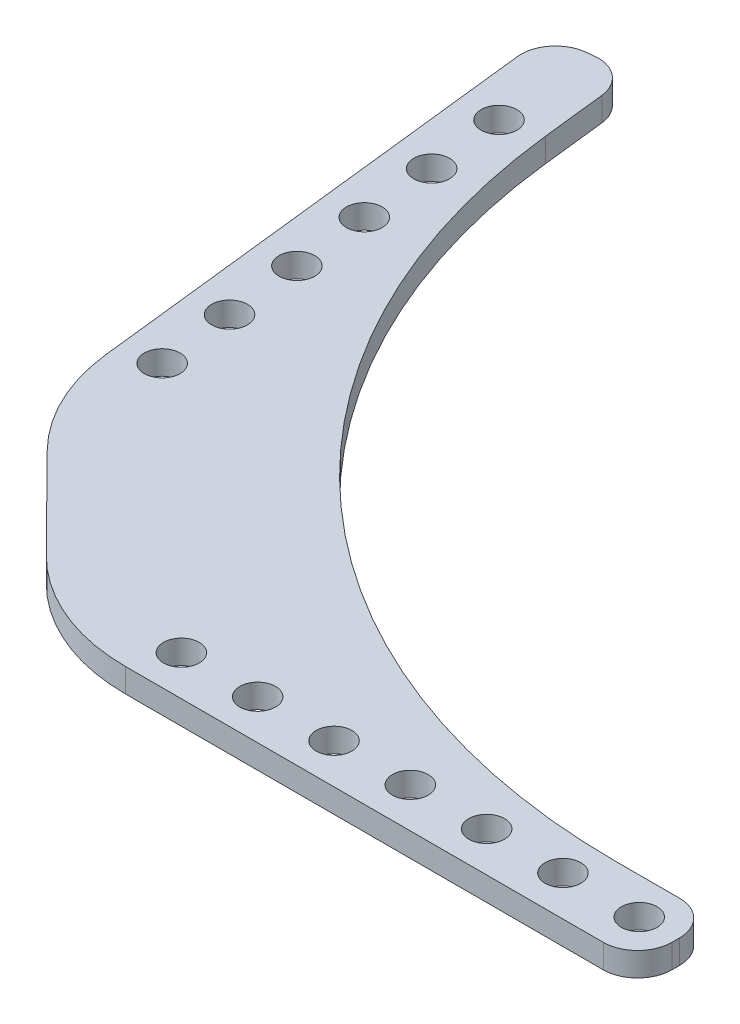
ISO-10303-21;
HEADER;
FILE_DESCRIPTION(('STEP AP214'),'2;1');
FILE_NAME('part.step','',(''),(''),'','','');
FILE_SCHEMA(('AUTOMOTIVE_DESIGN { 1 0 10303 214 1 1 1 1 }'));
ENDSEC;
DATA;
#1=APPLICATION_CONTEXT('core data for automotive mechanical design processes');
#2=APPLICATION_PROTOCOL_DEFINITION('international standard','automotive_design',2000,#1);
#3=PRODUCT_CONTEXT('',#1,'mechanical');
#4=PRODUCT('Part','Part','',(#3));
#5=PRODUCT_RELATED_PRODUCT_CATEGORY('part','',(#4));
#6=PRODUCT_DEFINITION_FORMATION('','',#4);
#7=PRODUCT_DEFINITION_CONTEXT('part definition',#1,'design');
#8=PRODUCT_DEFINITION('design','',#6,#7);
#9=PRODUCT_DEFINITION_SHAPE('','',#8);
#10=(LENGTH_UNIT() NAMED_UNIT(*) SI_UNIT(.MILLI.,.METRE.));
#11=(NAMED_UNIT(*) PLANE_ANGLE_UNIT() SI_UNIT($,.RADIAN.));
#12=(NAMED_UNIT(*) SI_UNIT($,.STERADIAN.) SOLID_ANGLE_UNIT());
#13=UNCERTAINTY_MEASURE_WITH_UNIT(LENGTH_MEASURE(1.E-05),#10,'distance_accuracy_value','');
#14=(GEOMETRIC_REPRESENTATION_CONTEXT(3) GLOBAL_UNCERTAINTY_ASSIGNED_CONTEXT((#13)) GLOBAL_UNIT_ASSIGNED_CONTEXT((#10,
#11,#12)) REPRESENTATION_CONTEXT('',''));
#15=CARTESIAN_POINT('',(0.,0.,0.));
#16=DIRECTION('',(0.,0.,1.));
#17=DIRECTION('',(1.,0.,0.));
#18=AXIS2_PLACEMENT_3D('',#15,#16,#17);
#19=CARTESIAN_POINT('',(-13.0169135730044,3.175,-88.9));
#20=DIRECTION('',(0.,1.,0.));
#21=DIRECTION('',(0.,0.,1.));
#22=AXIS2_PLACEMENT_3D('',#19,#20,#21);
#23=PLANE('',#22);
#24=CARTESIAN_POINT('',(-55.8883614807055,3.175,4.84965063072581));
#25=DIRECTION('',(0.,1.,0.));
#26=DIRECTION('',(0.,0.,1.));
#27=AXIS2_PLACEMENT_3D('',#24,#25,#26);
#28=CIRCLE('',#27,2.38125);
#29=CARTESIAN_POINT('',(-55.8883614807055,3.175,7.23090063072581));
#30=VERTEX_POINT('',#29);
#31=EDGE_CURVE('E329',#30,#30,#28,.T.);
#32=ORIENTED_EDGE('',*,*,#31,.F.);
#33=EDGE_LOOP('',(#32));
#34=FACE_BOUND('',#33,.T.);
#35=CARTESIAN_POINT('',(-35.5683614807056,3.175,4.84965063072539));
#36=DIRECTION('',(0.,1.,0.));
#37=DIRECTION('',(0.,0.,1.));
#38=AXIS2_PLACEMENT_3D('',#35,#36,#37);
#39=CIRCLE('',#38,2.38125);
#40=CARTESIAN_POINT('',(-35.5683614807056,3.175,7.23090063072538));
#41=VERTEX_POINT('',#40);
#42=EDGE_CURVE('E317',#41,#41,#39,.T.);
#43=ORIENTED_EDGE('',*,*,#42,.F.);
#44=EDGE_LOOP('',(#43));
#45=FACE_BOUND('',#44,.T.);
#46=CARTESIAN_POINT('',(-15.2483614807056,3.175,4.84965063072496));
#47=DIRECTION('',(0.,1.,0.));
#48=DIRECTION('',(0.,0.,1.));
#49=AXIS2_PLACEMENT_3D('',#46,#47,#48);
#50=CIRCLE('',#49,2.38125);
#51=CARTESIAN_POINT('',(-15.2483614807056,3.175,7.23090063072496));
#52=VERTEX_POINT('',#51);
#53=EDGE_CURVE('E305',#52,#52,#50,.T.);
#54=ORIENTED_EDGE('',*,*,#53,.F.);
#55=EDGE_LOOP('',(#54));
#56=FACE_BOUND('',#55,.T.);
#57=CARTESIAN_POINT('',(-101.816305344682,3.175,-37.3332472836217));
#58=DIRECTION('',(0.,1.,0.));
#59=DIRECTION('',(0.,0.,1.));
#60=AXIS2_PLACEMENT_3D('',#57,#58,#59);
#61=CIRCLE('',#60,2.38125);
#62=CARTESIAN_POINT('',(-101.816305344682,3.175,-34.9519972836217));
#63=VERTEX_POINT('',#62);
#64=EDGE_CURVE('E293',#63,#63,#61,.T.);
#65=ORIENTED_EDGE('',*,*,#64,.F.);
#66=EDGE_LOOP('',(#65));
#67=FACE_BOUND('',#66,.T.);
#68=CARTESIAN_POINT('',(-104.074122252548,3.175,-57.5274212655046));
#69=DIRECTION('',(0.,1.,0.));
#70=DIRECTION('',(0.,0.,1.));
#71=AXIS2_PLACEMENT_3D('',#68,#69,#70);
#72=CIRCLE('',#71,2.38125);
#73=CARTESIAN_POINT('',(-104.074122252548,3.175,-55.1461712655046));
#74=VERTEX_POINT('',#73);
#75=EDGE_CURVE('E281',#74,#74,#72,.T.);
#76=ORIENTED_EDGE('',*,*,#75,.F.);
#77=EDGE_LOOP('',(#76));
#78=FACE_BOUND('',#77,.T.);
#79=CARTESIAN_POINT('',(-5.08836148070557,3.175,4.84965063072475));
#80=DIRECTION('',(0.,1.,0.));
#81=DIRECTION('',(0.,0.,1.));
#82=AXIS2_PLACEMENT_3D('',#79,#80,#81);
#83=CIRCLE('',#82,2.38125);
#84=CARTESIAN_POINT('',(-5.08836148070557,3.175,7.23090063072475));
#85=VERTEX_POINT('',#84);
#86=EDGE_CURVE('E269',#85,#85,#83,.T.);
#87=ORIENTED_EDGE('',*,*,#86,.F.);
#88=EDGE_LOOP('',(#87));
#89=FACE_BOUND('',#88,.T.);
#90=DIRECTION('',(0.112162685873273,0.,0.993689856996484));
#91=VECTOR('',#90,1.);
#92=CARTESIAN_POINT('',(-112.408442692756,3.175,-86.2641860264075));
#93=LINE('',#92,#91);
#94=CARTESIAN_POINT('',(-112.408442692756,3.175,-86.2641860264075));
#95=VERTEX_POINT('',#94);
#96=CARTESIAN_POINT('',(-105.437628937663,3.175,-24.5072222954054));
#97=VERTEX_POINT('',#96);
#98=EDGE_CURVE('E181',#95,#97,#93,.T.);
#99=ORIENTED_EDGE('',*,*,#98,.T.);
#100=CARTESIAN_POINT('',(-80.1979065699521,3.175,-27.3561545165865));
#101=DIRECTION('',(0.,1.,0.));
#102=DIRECTION('',(0.,0.,1.));
#103=AXIS2_PLACEMENT_3D('',#100,#101,#102);
#104=CIRCLE('',#103,25.4);
#105=CARTESIAN_POINT('',(-98.246675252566,3.175,-9.48433454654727));
#106=VERTEX_POINT('',#105);
#107=EDGE_CURVE('E43',#97,#106,#104,.T.);
#108=ORIENTED_EDGE('',*,*,#107,.T.);
#109=DIRECTION('',(0.703614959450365,0.,0.710581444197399));
#110=VECTOR('',#109,1.);
#111=CARTESIAN_POINT('',(-104.448932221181,3.175,-15.748));
#112=LINE('',#111,#110);
#113=CARTESIAN_POINT('',(-86.2493065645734,3.175,2.63181997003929));
#114=VERTEX_POINT('',#113);
#115=EDGE_CURVE('E180',#106,#114,#112,.T.);
#116=ORIENTED_EDGE('',*,*,#115,.T.);
#117=CARTESIAN_POINT('',(-68.2005378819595,3.175,-15.24));
#118=DIRECTION('',(0.,1.,0.));
#119=DIRECTION('',(0.,0.,1.));
#120=AXIS2_PLACEMENT_3D('',#117,#118,#119);
#121=CIRCLE('',#120,25.4);
#122=CARTESIAN_POINT('',(-68.2005378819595,3.175,10.16));
#123=VERTEX_POINT('',#122);
#124=EDGE_CURVE('E50',#114,#123,#121,.T.);
#125=ORIENTED_EDGE('',*,*,#124,.T.);
#126=DIRECTION('',(1.,0.,0.));
#127=VECTOR('',#126,1.);
#128=CARTESIAN_POINT('',(-4.57200000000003,3.175,10.16));
#129=LINE('',#128,#127);
#130=CARTESIAN_POINT('',(-4.57200000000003,3.175,10.16));
#131=VERTEX_POINT('',#130);
#132=EDGE_CURVE('E189',#123,#131,#129,.T.);
#133=ORIENTED_EDGE('',*,*,#132,.T.);
#134=CARTESIAN_POINT('',(-4.572,3.175,5.588));
#135=DIRECTION('',(0.,1.,0.));
#136=DIRECTION('',(0.,0.,-1.));
#137=AXIS2_PLACEMENT_3D('',#134,#135,#136);
#138=CIRCLE('',#137,4.572);
#139=CARTESIAN_POINT('',(0.,3.175,5.58799999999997));
#140=VERTEX_POINT('',#139);
#141=EDGE_CURVE('E258',#131,#140,#138,.T.);
#142=ORIENTED_EDGE('',*,*,#141,.T.);
#143=DIRECTION('',(0.,0.,-1.));
#144=VECTOR('',#143,1.);
#145=CARTESIAN_POINT('',(0.,3.175,4.57200000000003));
#146=LINE('',#145,#144);
#147=CARTESIAN_POINT('',(0.,3.175,4.57200000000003));
#148=VERTEX_POINT('',#147);
#149=EDGE_CURVE('E256',#140,#148,#146,.T.);
#150=ORIENTED_EDGE('',*,*,#149,.T.);
#151=CARTESIAN_POINT('',(-4.572,3.175,4.572));
#152=DIRECTION('',(0.,1.,0.));
#153=DIRECTION('',(0.,0.,1.));
#154=AXIS2_PLACEMENT_3D('',#151,#152,#153);
#155=CIRCLE('',#154,4.572);
#156=CARTESIAN_POINT('',(-4.57200000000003,3.175,0.));
#157=VERTEX_POINT('',#156);
#158=EDGE_CURVE('E254',#148,#157,#155,.T.);
#159=ORIENTED_EDGE('',*,*,#158,.T.);
#160=DIRECTION('',(-1.,0.,0.));
#161=VECTOR('',#160,1.);
#162=CARTESIAN_POINT('',(-13.0169135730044,3.175,0.));
#163=LINE('',#162,#161);
#164=CARTESIAN_POINT('',(-13.0169135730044,3.175,0.));
#165=VERTEX_POINT('',#164);
#166=EDGE_CURVE('E154',#157,#165,#163,.T.);
#167=ORIENTED_EDGE('',*,*,#166,.T.);
#168=CARTESIAN_POINT('',(-13.0169135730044,3.175,-88.9));
#169=DIRECTION('',(0.,-1.,0.));
#170=DIRECTION('',(0.,0.,1.));
#171=AXIS2_PLACEMENT_3D('',#168,#169,#170);
#172=CIRCLE('',#171,88.9);
#173=CARTESIAN_POINT('',(-101.355941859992,3.175,-78.928737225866));
#174=VERTEX_POINT('',#173);
#175=EDGE_CURVE('E149',#165,#174,#172,.T.);
#176=ORIENTED_EDGE('',*,*,#175,.T.);
#177=DIRECTION('',(-0.112162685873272,0.,-0.993689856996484));
#178=VECTOR('',#177,1.);
#179=CARTESIAN_POINT('',(-102.311355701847,3.175,-87.3930944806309));
#180=LINE('',#179,#178);
#181=CARTESIAN_POINT('',(-102.311355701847,3.175,-87.3930944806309));
#182=VERTEX_POINT('',#181);
#183=EDGE_CURVE('E139',#174,#182,#180,.T.);
#184=ORIENTED_EDGE('',*,*,#183,.T.);
#185=CARTESIAN_POINT('',(-106.854505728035,3.175,-86.8802866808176));
#186=DIRECTION('',(0.,1.,0.));
#187=DIRECTION('',(0.,0.,-1.));
#188=AXIS2_PLACEMENT_3D('',#185,#186,#187);
#189=CIRCLE('',#188,4.57200000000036);
#190=CARTESIAN_POINT('',(-107.362514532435,3.175,-91.423975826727));
#191=VERTEX_POINT('',#190);
#192=EDGE_CURVE('E148',#182,#191,#189,.T.);
#193=ORIENTED_EDGE('',*,*,#192,.T.);
#194=DIRECTION('',(-0.993807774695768,0.,0.111113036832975));
#195=VECTOR('',#194,1.);
#196=CARTESIAN_POINT('',(-108.372228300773,3.175,-91.3110844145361));
#197=LINE('',#196,#195);
#198=CARTESIAN_POINT('',(-108.372228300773,3.175,-91.3110844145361));
#199=VERTEX_POINT('',#198);
#200=EDGE_CURVE('E243',#191,#199,#197,.T.);
#201=ORIENTED_EDGE('',*,*,#200,.T.);
#202=CARTESIAN_POINT('',(-107.864219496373,3.175,-86.7673952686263));
#203=DIRECTION('',(0.,1.,0.));
#204=DIRECTION('',(0.,0.,-1.));
#205=AXIS2_PLACEMENT_3D('',#202,#203,#204);
#206=CIRCLE('',#205,4.5720000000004);
#207=EDGE_CURVE('E262',#199,#95,#206,.T.);
#208=ORIENTED_EDGE('',*,*,#207,.T.);
#209=EDGE_LOOP('',(#99,#108,#116,#125,#133,#142,#150,#159,#167,#176,#184,#193,#201,#208));
#210=FACE_BOUND('',#209,.T.);
#211=CARTESIAN_POINT('',(-106.331939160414,3.175,-77.7215952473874));
#212=DIRECTION('',(0.,1.,0.));
#213=DIRECTION('',(0.,0.,1.));
#214=AXIS2_PLACEMENT_3D('',#211,#212,#213);
#215=CIRCLE('',#214,2.38125);
#216=CARTESIAN_POINT('',(-106.331939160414,3.175,-75.3403452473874));
#217=VERTEX_POINT('',#216);
#218=EDGE_CURVE('E252',#217,#217,#215,.T.);
#219=ORIENTED_EDGE('',*,*,#218,.F.);
#220=EDGE_LOOP('',(#219));
#221=FACE_BOUND('',#220,.T.);
#222=CARTESIAN_POINT('',(-105.203030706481,3.175,-67.624508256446));
#223=DIRECTION('',(0.,1.,0.));
#224=DIRECTION('',(0.,0.,1.));
#225=AXIS2_PLACEMENT_3D('',#222,#223,#224);
#226=CIRCLE('',#225,2.38125);
#227=CARTESIAN_POINT('',(-105.203030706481,3.175,-65.243258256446));
#228=VERTEX_POINT('',#227);
#229=EDGE_CURVE('E275',#228,#228,#226,.T.);
#230=ORIENTED_EDGE('',*,*,#229,.F.);
#231=EDGE_LOOP('',(#230));
#232=FACE_BOUND('',#231,.T.);
#233=CARTESIAN_POINT('',(-102.945213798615,3.175,-47.4303342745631));
#234=DIRECTION('',(0.,1.,0.));
#235=DIRECTION('',(0.,0.,1.));
#236=AXIS2_PLACEMENT_3D('',#233,#234,#235);
#237=CIRCLE('',#236,2.38125);
#238=CARTESIAN_POINT('',(-102.945213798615,3.175,-45.0490842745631));
#239=VERTEX_POINT('',#238);
#240=EDGE_CURVE('E287',#239,#239,#237,.T.);
#241=ORIENTED_EDGE('',*,*,#240,.F.);
#242=EDGE_LOOP('',(#241));
#243=FACE_BOUND('',#242,.T.);
#244=CARTESIAN_POINT('',(-100.687396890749,3.175,-27.2361602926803));
#245=DIRECTION('',(0.,1.,0.));
#246=DIRECTION('',(0.,0.,1.));
#247=AXIS2_PLACEMENT_3D('',#244,#245,#246);
#248=CIRCLE('',#247,2.38125000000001);
#249=CARTESIAN_POINT('',(-100.687396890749,3.175,-24.8549102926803));
#250=VERTEX_POINT('',#249);
#251=EDGE_CURVE('E299',#250,#250,#248,.T.);
#252=ORIENTED_EDGE('',*,*,#251,.F.);
#253=EDGE_LOOP('',(#252));
#254=FACE_BOUND('',#253,.T.);
#255=CARTESIAN_POINT('',(-25.4083614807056,3.175,4.84965063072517));
#256=DIRECTION('',(0.,1.,0.));
#257=DIRECTION('',(0.,0.,1.));
#258=AXIS2_PLACEMENT_3D('',#255,#256,#257);
#259=CIRCLE('',#258,2.38125);
#260=CARTESIAN_POINT('',(-25.4083614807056,3.175,7.23090063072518));
#261=VERTEX_POINT('',#260);
#262=EDGE_CURVE('E311',#261,#261,#259,.T.);
#263=ORIENTED_EDGE('',*,*,#262,.F.);
#264=EDGE_LOOP('',(#263));
#265=FACE_BOUND('',#264,.T.);
#266=CARTESIAN_POINT('',(-45.7283614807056,3.175,4.8496506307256));
#267=DIRECTION('',(0.,1.,0.));
#268=DIRECTION('',(0.,0.,1.));
#269=AXIS2_PLACEMENT_3D('',#266,#267,#268);
#270=CIRCLE('',#269,2.38125);
#271=CARTESIAN_POINT('',(-45.7283614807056,3.175,7.2309006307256));
#272=VERTEX_POINT('',#271);
#273=EDGE_CURVE('E323',#272,#272,#270,.T.);
#274=ORIENTED_EDGE('',*,*,#273,.F.);
#275=EDGE_LOOP('',(#274));
#276=FACE_BOUND('',#275,.T.);
#277=CARTESIAN_POINT('',(-66.0483614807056,3.175,4.84965063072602));
#278=DIRECTION('',(0.,1.,0.));
#279=DIRECTION('',(0.,0.,1.));
#280=AXIS2_PLACEMENT_3D('',#277,#278,#279);
#281=CIRCLE('',#280,2.38125000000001);
#282=CARTESIAN_POINT('',(-66.0483614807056,3.175,7.23090063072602));
#283=VERTEX_POINT('',#282);
#284=EDGE_CURVE('E335',#283,#283,#281,.T.);
#285=ORIENTED_EDGE('',*,*,#284,.F.);
#286=EDGE_LOOP('',(#285));
#287=FACE_BOUND('',#286,.T.);
#288=ADVANCED_FACE('F35',(#34,#45,#56,#67,#78,#89,#210,#221,#232,#243,#254,#265,#276,#287),#23,.T.);
#289=CARTESIAN_POINT('',(-13.0169135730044,0.,-88.9));
#290=DIRECTION('',(0.,1.,0.));
#291=DIRECTION('',(0.,0.,1.));
#292=AXIS2_PLACEMENT_3D('',#289,#290,#291);
#293=PLANE('',#292);
#294=DIRECTION('',(0.703614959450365,0.,0.710581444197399));
#295=VECTOR('',#294,1.);
#296=CARTESIAN_POINT('',(-104.448932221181,0.,-15.748));
#297=LINE('',#296,#295);
#298=CARTESIAN_POINT('',(-98.246675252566,0.,-9.48433454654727));
#299=VERTEX_POINT('',#298);
#300=CARTESIAN_POINT('',(-86.2493065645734,0.,2.63181997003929));
#301=VERTEX_POINT('',#300);
#302=EDGE_CURVE('E198',#299,#301,#297,.T.);
#303=ORIENTED_EDGE('',*,*,#302,.F.);
#304=CARTESIAN_POINT('',(-80.1979065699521,0.,-27.3561545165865));
#305=DIRECTION('',(0.,1.,0.));
#306=DIRECTION('',(0.,0.,1.));
#307=AXIS2_PLACEMENT_3D('',#304,#305,#306);
#308=CIRCLE('',#307,25.4);
#309=CARTESIAN_POINT('',(-105.437628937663,0.,-24.5072222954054));
#310=VERTEX_POINT('',#309);
#311=EDGE_CURVE('E175',#299,#310,#308,.F.);
#312=ORIENTED_EDGE('',*,*,#311,.T.);
#313=DIRECTION('',(0.112162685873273,0.,0.993689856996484));
#314=VECTOR('',#313,1.);
#315=CARTESIAN_POINT('',(-112.408442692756,0.,-86.2641860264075));
#316=LINE('',#315,#314);
#317=CARTESIAN_POINT('',(-112.408442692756,0.,-86.2641860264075));
#318=VERTEX_POINT('',#317);
#319=EDGE_CURVE('E197',#318,#310,#316,.T.);
#320=ORIENTED_EDGE('',*,*,#319,.F.);
#321=CARTESIAN_POINT('',(-107.864219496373,0.,-86.7673952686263));
#322=DIRECTION('',(0.,1.,0.));
#323=DIRECTION('',(0.,0.,-1.));
#324=AXIS2_PLACEMENT_3D('',#321,#322,#323);
#325=CIRCLE('',#324,4.5720000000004);
#326=CARTESIAN_POINT('',(-108.372228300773,0.,-91.3110844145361));
#327=VERTEX_POINT('',#326);
#328=EDGE_CURVE('E203',#327,#318,#325,.T.);
#329=ORIENTED_EDGE('',*,*,#328,.F.);
#330=DIRECTION('',(-0.993807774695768,0.,0.111113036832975));
#331=VECTOR('',#330,1.);
#332=CARTESIAN_POINT('',(-108.372228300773,0.,-91.3110844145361));
#333=LINE('',#332,#331);
#334=CARTESIAN_POINT('',(-107.362514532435,0.,-91.423975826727));
#335=VERTEX_POINT('',#334);
#336=EDGE_CURVE('E207',#335,#327,#333,.T.);
#337=ORIENTED_EDGE('',*,*,#336,.F.);
#338=CARTESIAN_POINT('',(-106.854505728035,0.,-86.8802866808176));
#339=DIRECTION('',(0.,1.,0.));
#340=DIRECTION('',(0.,0.,-1.));
#341=AXIS2_PLACEMENT_3D('',#338,#339,#340);
#342=CIRCLE('',#341,4.57200000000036);
#343=CARTESIAN_POINT('',(-102.311355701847,0.,-87.3930944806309));
#344=VERTEX_POINT('',#343);
#345=EDGE_CURVE('E246',#344,#335,#342,.T.);
#346=ORIENTED_EDGE('',*,*,#345,.F.);
#347=DIRECTION('',(-0.112162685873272,0.,-0.993689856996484));
#348=VECTOR('',#347,1.);
#349=CARTESIAN_POINT('',(-102.311355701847,0.,-87.3930944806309));
#350=LINE('',#349,#348);
#351=CARTESIAN_POINT('',(-101.355941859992,0.,-78.928737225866));
#352=VERTEX_POINT('',#351);
#353=EDGE_CURVE('E247',#352,#344,#350,.T.);
#354=ORIENTED_EDGE('',*,*,#353,.F.);
#355=CARTESIAN_POINT('',(-13.0169135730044,0.,-88.9));
#356=DIRECTION('',(0.,-1.,0.));
#357=DIRECTION('',(0.,0.,1.));
#358=AXIS2_PLACEMENT_3D('',#355,#356,#357);
#359=CIRCLE('',#358,88.9);
#360=CARTESIAN_POINT('',(-13.0169135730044,0.,0.));
#361=VERTEX_POINT('',#360);
#362=EDGE_CURVE('E162',#361,#352,#359,.T.);
#363=ORIENTED_EDGE('',*,*,#362,.F.);
#364=DIRECTION('',(-1.,0.,0.));
#365=VECTOR('',#364,1.);
#366=CARTESIAN_POINT('',(-13.0169135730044,0.,0.));
#367=LINE('',#366,#365);
#368=CARTESIAN_POINT('',(-4.57200000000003,0.,0.));
#369=VERTEX_POINT('',#368);
#370=EDGE_CURVE('E158',#369,#361,#367,.T.);
#371=ORIENTED_EDGE('',*,*,#370,.F.);
#372=CARTESIAN_POINT('',(-4.572,0.,4.572));
#373=DIRECTION('',(0.,1.,0.));
#374=DIRECTION('',(0.,0.,1.));
#375=AXIS2_PLACEMENT_3D('',#372,#373,#374);
#376=CIRCLE('',#375,4.572);
#377=CARTESIAN_POINT('',(0.,0.,4.57200000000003));
#378=VERTEX_POINT('',#377);
#379=EDGE_CURVE('E216',#378,#369,#376,.T.);
#380=ORIENTED_EDGE('',*,*,#379,.F.);
#381=DIRECTION('',(0.,0.,-1.));
#382=VECTOR('',#381,1.);
#383=CARTESIAN_POINT('',(0.,0.,4.57200000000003));
#384=LINE('',#383,#382);
#385=CARTESIAN_POINT('',(0.,0.,5.58799999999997));
#386=VERTEX_POINT('',#385);
#387=EDGE_CURVE('E214',#386,#378,#384,.T.);
#388=ORIENTED_EDGE('',*,*,#387,.F.);
#389=CARTESIAN_POINT('',(-4.572,0.,5.588));
#390=DIRECTION('',(0.,1.,0.));
#391=DIRECTION('',(0.,0.,-1.));
#392=AXIS2_PLACEMENT_3D('',#389,#390,#391);
#393=CIRCLE('',#392,4.572);
#394=CARTESIAN_POINT('',(-4.57200000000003,0.,10.16));
#395=VERTEX_POINT('',#394);
#396=EDGE_CURVE('E212',#395,#386,#393,.T.);
#397=ORIENTED_EDGE('',*,*,#396,.F.);
#398=DIRECTION('',(1.,0.,0.));
#399=VECTOR('',#398,1.);
#400=CARTESIAN_POINT('',(-4.57200000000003,0.,10.16));
#401=LINE('',#400,#399);
#402=CARTESIAN_POINT('',(-68.2005378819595,0.,10.16));
#403=VERTEX_POINT('',#402);
#404=EDGE_CURVE('E205',#403,#395,#401,.T.);
#405=ORIENTED_EDGE('',*,*,#404,.F.);
#406=CARTESIAN_POINT('',(-68.2005378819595,0.,-15.24));
#407=DIRECTION('',(0.,1.,0.));
#408=DIRECTION('',(0.,0.,1.));
#409=AXIS2_PLACEMENT_3D('',#406,#407,#408);
#410=CIRCLE('',#409,25.4);
#411=EDGE_CURVE('E173',#403,#301,#410,.F.);
#412=ORIENTED_EDGE('',*,*,#411,.T.);
#413=EDGE_LOOP('',(#303,#312,#320,#329,#337,#346,#354,#363,#371,#380,#388,#397,#405,#412));
#414=FACE_BOUND('',#413,.T.);
#415=CARTESIAN_POINT('',(-106.331939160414,0.,-77.7215952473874));
#416=DIRECTION('',(0.,1.,0.));
#417=DIRECTION('',(0.,0.,1.));
#418=AXIS2_PLACEMENT_3D('',#415,#416,#417);
#419=CIRCLE('',#418,2.38125);
#420=CARTESIAN_POINT('',(-106.331939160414,0.,-75.3403452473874));
#421=VERTEX_POINT('',#420);
#422=EDGE_CURVE('E266',#421,#421,#419,.T.);
#423=ORIENTED_EDGE('',*,*,#422,.T.);
#424=EDGE_LOOP('',(#423));
#425=FACE_BOUND('',#424,.T.);
#426=CARTESIAN_POINT('',(-5.08836148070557,0.,4.84965063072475));
#427=DIRECTION('',(0.,1.,0.));
#428=DIRECTION('',(0.,0.,1.));
#429=AXIS2_PLACEMENT_3D('',#426,#427,#428);
#430=CIRCLE('',#429,2.38125);
#431=CARTESIAN_POINT('',(-5.08836148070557,0.,7.23090063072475));
#432=VERTEX_POINT('',#431);
#433=EDGE_CURVE('E272',#432,#432,#430,.T.);
#434=ORIENTED_EDGE('',*,*,#433,.T.);
#435=EDGE_LOOP('',(#434));
#436=FACE_BOUND('',#435,.T.);
#437=CARTESIAN_POINT('',(-105.203030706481,0.,-67.624508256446));
#438=DIRECTION('',(0.,1.,0.));
#439=DIRECTION('',(0.,0.,1.));
#440=AXIS2_PLACEMENT_3D('',#437,#438,#439);
#441=CIRCLE('',#440,2.38125);
#442=CARTESIAN_POINT('',(-105.203030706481,0.,-65.243258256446));
#443=VERTEX_POINT('',#442);
#444=EDGE_CURVE('E278',#443,#443,#441,.T.);
#445=ORIENTED_EDGE('',*,*,#444,.T.);
#446=EDGE_LOOP('',(#445));
#447=FACE_BOUND('',#446,.T.);
#448=CARTESIAN_POINT('',(-104.074122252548,0.,-57.5274212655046));
#449=DIRECTION('',(0.,1.,0.));
#450=DIRECTION('',(0.,0.,1.));
#451=AXIS2_PLACEMENT_3D('',#448,#449,#450);
#452=CIRCLE('',#451,2.38125);
#453=CARTESIAN_POINT('',(-104.074122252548,0.,-55.1461712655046));
#454=VERTEX_POINT('',#453);
#455=EDGE_CURVE('E284',#454,#454,#452,.T.);
#456=ORIENTED_EDGE('',*,*,#455,.T.);
#457=EDGE_LOOP('',(#456));
#458=FACE_BOUND('',#457,.T.);
#459=CARTESIAN_POINT('',(-102.945213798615,0.,-47.4303342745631));
#460=DIRECTION('',(0.,1.,0.));
#461=DIRECTION('',(0.,0.,1.));
#462=AXIS2_PLACEMENT_3D('',#459,#460,#461);
#463=CIRCLE('',#462,2.38125);
#464=CARTESIAN_POINT('',(-102.945213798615,0.,-45.0490842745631));
#465=VERTEX_POINT('',#464);
#466=EDGE_CURVE('E290',#465,#465,#463,.T.);
#467=ORIENTED_EDGE('',*,*,#466,.T.);
#468=EDGE_LOOP('',(#467));
#469=FACE_BOUND('',#468,.T.);
#470=CARTESIAN_POINT('',(-101.816305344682,0.,-37.3332472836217));
#471=DIRECTION('',(0.,1.,0.));
#472=DIRECTION('',(0.,0.,1.));
#473=AXIS2_PLACEMENT_3D('',#470,#471,#472);
#474=CIRCLE('',#473,2.38125);
#475=CARTESIAN_POINT('',(-101.816305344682,0.,-34.9519972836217));
#476=VERTEX_POINT('',#475);
#477=EDGE_CURVE('E296',#476,#476,#474,.T.);
#478=ORIENTED_EDGE('',*,*,#477,.T.);
#479=EDGE_LOOP('',(#478));
#480=FACE_BOUND('',#479,.T.);
#481=CARTESIAN_POINT('',(-100.687396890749,0.,-27.2361602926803));
#482=DIRECTION('',(0.,1.,0.));
#483=DIRECTION('',(0.,0.,1.));
#484=AXIS2_PLACEMENT_3D('',#481,#482,#483);
#485=CIRCLE('',#484,2.38125000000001);
#486=CARTESIAN_POINT('',(-100.687396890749,0.,-24.8549102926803));
#487=VERTEX_POINT('',#486);
#488=EDGE_CURVE('E302',#487,#487,#485,.T.);
#489=ORIENTED_EDGE('',*,*,#488,.T.);
#490=EDGE_LOOP('',(#489));
#491=FACE_BOUND('',#490,.T.);
#492=CARTESIAN_POINT('',(-15.2483614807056,0.,4.84965063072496));
#493=DIRECTION('',(0.,1.,0.));
#494=DIRECTION('',(0.,0.,1.));
#495=AXIS2_PLACEMENT_3D('',#492,#493,#494);
#496=CIRCLE('',#495,2.38125);
#497=CARTESIAN_POINT('',(-15.2483614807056,0.,7.23090063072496));
#498=VERTEX_POINT('',#497);
#499=EDGE_CURVE('E308',#498,#498,#496,.T.);
#500=ORIENTED_EDGE('',*,*,#499,.T.);
#501=EDGE_LOOP('',(#500));
#502=FACE_BOUND('',#501,.T.);
#503=CARTESIAN_POINT('',(-25.4083614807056,0.,4.84965063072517));
#504=DIRECTION('',(0.,1.,0.));
#505=DIRECTION('',(0.,0.,1.));
#506=AXIS2_PLACEMENT_3D('',#503,#504,#505);
#507=CIRCLE('',#506,2.38125);
#508=CARTESIAN_POINT('',(-25.4083614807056,0.,7.23090063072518));
#509=VERTEX_POINT('',#508);
#510=EDGE_CURVE('E314',#509,#509,#507,.T.);
#511=ORIENTED_EDGE('',*,*,#510,.T.);
#512=EDGE_LOOP('',(#511));
#513=FACE_BOUND('',#512,.T.);
#514=CARTESIAN_POINT('',(-35.5683614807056,0.,4.84965063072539));
#515=DIRECTION('',(0.,1.,0.));
#516=DIRECTION('',(0.,0.,1.));
#517=AXIS2_PLACEMENT_3D('',#514,#515,#516);
#518=CIRCLE('',#517,2.38125);
#519=CARTESIAN_POINT('',(-35.5683614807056,0.,7.23090063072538));
#520=VERTEX_POINT('',#519);
#521=EDGE_CURVE('E320',#520,#520,#518,.T.);
#522=ORIENTED_EDGE('',*,*,#521,.T.);
#523=EDGE_LOOP('',(#522));
#524=FACE_BOUND('',#523,.T.);
#525=CARTESIAN_POINT('',(-45.7283614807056,0.,4.8496506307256));
#526=DIRECTION('',(0.,1.,0.));
#527=DIRECTION('',(0.,0.,1.));
#528=AXIS2_PLACEMENT_3D('',#525,#526,#527);
#529=CIRCLE('',#528,2.38125);
#530=CARTESIAN_POINT('',(-45.7283614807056,0.,7.2309006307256));
#531=VERTEX_POINT('',#530);
#532=EDGE_CURVE('E326',#531,#531,#529,.T.);
#533=ORIENTED_EDGE('',*,*,#532,.T.);
#534=EDGE_LOOP('',(#533));
#535=FACE_BOUND('',#534,.T.);
#536=CARTESIAN_POINT('',(-55.8883614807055,0.,4.84965063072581));
#537=DIRECTION('',(0.,1.,0.));
#538=DIRECTION('',(0.,0.,1.));
#539=AXIS2_PLACEMENT_3D('',#536,#537,#538);
#540=CIRCLE('',#539,2.38125);
#541=CARTESIAN_POINT('',(-55.8883614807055,0.,7.23090063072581));
#542=VERTEX_POINT('',#541);
#543=EDGE_CURVE('E332',#542,#542,#540,.T.);
#544=ORIENTED_EDGE('',*,*,#543,.T.);
#545=EDGE_LOOP('',(#544));
#546=FACE_BOUND('',#545,.T.);
#547=CARTESIAN_POINT('',(-66.0483614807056,0.,4.84965063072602));
#548=DIRECTION('',(0.,1.,0.));
#549=DIRECTION('',(0.,0.,1.));
#550=AXIS2_PLACEMENT_3D('',#547,#548,#549);
#551=CIRCLE('',#550,2.38125000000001);
#552=CARTESIAN_POINT('',(-66.0483614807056,0.,7.23090063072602));
#553=VERTEX_POINT('',#552);
#554=EDGE_CURVE('E338',#553,#553,#551,.T.);
#555=ORIENTED_EDGE('',*,*,#554,.T.);
#556=EDGE_LOOP('',(#555));
#557=FACE_BOUND('',#556,.T.);
#558=ADVANCED_FACE('F194',(#414,#425,#436,#447,#458,#469,#480,#491,#502,#513,#524,#535,#546,
#557),#293,.F.);
#559=CARTESIAN_POINT('',(-13.0169135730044,3.175,-88.9));
#560=DIRECTION('',(0.,-1.,0.));
#561=DIRECTION('',(0.,0.,-1.));
#562=AXIS2_PLACEMENT_3D('',#559,#560,#561);
#563=CYLINDRICAL_SURFACE('',#562,88.9);
#564=ORIENTED_EDGE('',*,*,#362,.T.);
#565=DIRECTION('',(0.,-1.,0.));
#566=VECTOR('',#565,1.);
#567=CARTESIAN_POINT('',(-101.355941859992,3.175,-78.928737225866));
#568=LINE('',#567,#566);
#569=EDGE_CURVE('E143',#174,#352,#568,.T.);
#570=ORIENTED_EDGE('',*,*,#569,.F.);
#571=ORIENTED_EDGE('',*,*,#175,.F.);
#572=DIRECTION('',(0.,-1.,0.));
#573=VECTOR('',#572,1.);
#574=CARTESIAN_POINT('',(-13.0169135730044,3.175,0.));
#575=LINE('',#574,#573);
#576=EDGE_CURVE('E219',#165,#361,#575,.T.);
#577=ORIENTED_EDGE('',*,*,#576,.T.);
#578=EDGE_LOOP('',(#564,#570,#571,#577));
#579=FACE_BOUND('',#578,.T.);
#580=ADVANCED_FACE('F160',(#579),#563,.F.);
#581=CARTESIAN_POINT('',(-102.311355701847,3.175,-87.3930944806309));
#582=DIRECTION('',(-0.993689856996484,0.,0.112162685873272));
#583=DIRECTION('',(0.112162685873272,0.,0.993689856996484));
#584=AXIS2_PLACEMENT_3D('',#581,#582,#583);
#585=PLANE('',#584);
#586=ORIENTED_EDGE('',*,*,#353,.T.);
#587=DIRECTION('',(0.,-1.,0.));
#588=VECTOR('',#587,1.);
#589=CARTESIAN_POINT('',(-102.311355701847,3.175,-87.3930944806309));
#590=LINE('',#589,#588);
#591=EDGE_CURVE('E146',#182,#344,#590,.T.);
#592=ORIENTED_EDGE('',*,*,#591,.F.);
#593=ORIENTED_EDGE('',*,*,#183,.F.);
#594=ORIENTED_EDGE('',*,*,#569,.T.);
#595=EDGE_LOOP('',(#586,#592,#593,#594));
#596=FACE_BOUND('',#595,.T.);
#597=ADVANCED_FACE('F141',(#596),#585,.F.);
#598=CARTESIAN_POINT('',(-106.854505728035,3.175,-86.8802866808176));
#599=DIRECTION('',(0.,-1.,0.));
#600=DIRECTION('',(0.,0.,-1.));
#601=AXIS2_PLACEMENT_3D('',#598,#599,#600);
#602=CYLINDRICAL_SURFACE('',#601,4.57200000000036);
#603=ORIENTED_EDGE('',*,*,#345,.T.);
#604=DIRECTION('',(0.,-1.,0.));
#605=VECTOR('',#604,1.);
#606=CARTESIAN_POINT('',(-107.362514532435,3.175,-91.423975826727));
#607=LINE('',#606,#605);
#608=EDGE_CURVE('E167',#191,#335,#607,.T.);
#609=ORIENTED_EDGE('',*,*,#608,.F.);
#610=ORIENTED_EDGE('',*,*,#192,.F.);
#611=ORIENTED_EDGE('',*,*,#591,.T.);
#612=EDGE_LOOP('',(#603,#609,#610,#611));
#613=FACE_BOUND('',#612,.T.);
#614=ADVANCED_FACE('F390',(#613),#602,.T.);
#615=CARTESIAN_POINT('',(-108.372228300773,3.175,-91.3110844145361));
#616=DIRECTION('',(0.111113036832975,0.,0.993807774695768));
#617=DIRECTION('',(0.993807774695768,0.,-0.111113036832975));
#618=AXIS2_PLACEMENT_3D('',#615,#616,#617);
#619=PLANE('',#618);
#620=ORIENTED_EDGE('',*,*,#336,.T.);
#621=DIRECTION('',(0.,-1.,0.));
#622=VECTOR('',#621,1.);
#623=CARTESIAN_POINT('',(-108.372228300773,3.175,-91.3110844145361));
#624=LINE('',#623,#622);
#625=EDGE_CURVE('E234',#199,#327,#624,.T.);
#626=ORIENTED_EDGE('',*,*,#625,.F.);
#627=ORIENTED_EDGE('',*,*,#200,.F.);
#628=ORIENTED_EDGE('',*,*,#608,.T.);
#629=EDGE_LOOP('',(#620,#626,#627,#628));
#630=FACE_BOUND('',#629,.T.);
#631=ADVANCED_FACE('F241',(#630),#619,.F.);
#632=CARTESIAN_POINT('',(-107.864219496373,3.175,-86.7673952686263));
#633=DIRECTION('',(0.,-1.,0.));
#634=DIRECTION('',(0.,0.,-1.));
#635=AXIS2_PLACEMENT_3D('',#632,#633,#634);
#636=CYLINDRICAL_SURFACE('',#635,4.5720000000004);
#637=ORIENTED_EDGE('',*,*,#328,.T.);
#638=DIRECTION('',(0.,-1.,0.));
#639=VECTOR('',#638,1.);
#640=CARTESIAN_POINT('',(-112.408442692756,3.175,-86.2641860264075));
#641=LINE('',#640,#639);
#642=EDGE_CURVE('E202',#95,#318,#641,.T.);
#643=ORIENTED_EDGE('',*,*,#642,.F.);
#644=ORIENTED_EDGE('',*,*,#207,.F.);
#645=ORIENTED_EDGE('',*,*,#625,.T.);
#646=EDGE_LOOP('',(#637,#643,#644,#645));
#647=FACE_BOUND('',#646,.T.);
#648=ADVANCED_FACE('F384',(#647),#636,.T.);
#649=CARTESIAN_POINT('',(-112.408442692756,3.175,-86.2641860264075));
#650=DIRECTION('',(0.993689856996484,0.,-0.112162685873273));
#651=DIRECTION('',(-0.112162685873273,0.,-0.993689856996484));
#652=AXIS2_PLACEMENT_3D('',#649,#650,#651);
#653=PLANE('',#652);
#654=ORIENTED_EDGE('',*,*,#319,.T.);
#655=DIRECTION('',(0.,-1.,0.));
#656=VECTOR('',#655,1.);
#657=CARTESIAN_POINT('',(-105.437628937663,3.175,-24.5072222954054));
#658=LINE('',#657,#656);
#659=EDGE_CURVE('E58',#310,#97,#658,.F.);
#660=ORIENTED_EDGE('',*,*,#659,.T.);
#661=ORIENTED_EDGE('',*,*,#98,.F.);
#662=ORIENTED_EDGE('',*,*,#642,.T.);
#663=EDGE_LOOP('',(#654,#660,#661,#662));
#664=FACE_BOUND('',#663,.T.);
#665=ADVANCED_FACE('F200',(#664),#653,.F.);
#666=CARTESIAN_POINT('',(-104.448932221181,3.175,-15.748));
#667=DIRECTION('',(0.710581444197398,0.,-0.703614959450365));
#668=DIRECTION('',(-0.703614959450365,0.,-0.710581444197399));
#669=AXIS2_PLACEMENT_3D('',#666,#667,#668);
#670=PLANE('',#669);
#671=ORIENTED_EDGE('',*,*,#115,.F.);
#672=DIRECTION('',(0.,-1.,0.));
#673=VECTOR('',#672,1.);
#674=CARTESIAN_POINT('',(-98.246675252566,3.175,-9.48433454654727));
#675=LINE('',#674,#673);
#676=EDGE_CURVE('E165',#106,#299,#675,.T.);
#677=ORIENTED_EDGE('',*,*,#676,.T.);
#678=ORIENTED_EDGE('',*,*,#302,.T.);
#679=DIRECTION('',(0.,-1.,0.));
#680=VECTOR('',#679,1.);
#681=CARTESIAN_POINT('',(-86.2493065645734,3.175,2.63181997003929));
#682=LINE('',#681,#680);
#683=EDGE_CURVE('E163',#301,#114,#682,.F.);
#684=ORIENTED_EDGE('',*,*,#683,.T.);
#685=EDGE_LOOP('',(#671,#677,#678,#684));
#686=FACE_BOUND('',#685,.T.);
#687=ADVANCED_FACE('F185',(#686),#670,.F.);
#688=CARTESIAN_POINT('',(-4.57200000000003,3.175,10.16));
#689=DIRECTION('',(0.,0.,-1.));
#690=DIRECTION('',(-1.,0.,0.));
#691=AXIS2_PLACEMENT_3D('',#688,#689,#690);
#692=PLANE('',#691);
#693=ORIENTED_EDGE('',*,*,#132,.F.);
#694=DIRECTION('',(0.,-1.,0.));
#695=VECTOR('',#694,1.);
#696=CARTESIAN_POINT('',(-68.2005378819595,3.175,10.16));
#697=LINE('',#696,#695);
#698=EDGE_CURVE('E11',#123,#403,#697,.T.);
#699=ORIENTED_EDGE('',*,*,#698,.T.);
#700=ORIENTED_EDGE('',*,*,#404,.T.);
#701=DIRECTION('',(0.,-1.,0.));
#702=VECTOR('',#701,1.);
#703=CARTESIAN_POINT('',(-4.57200000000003,3.175,10.16));
#704=LINE('',#703,#702);
#705=EDGE_CURVE('E230',#131,#395,#704,.T.);
#706=ORIENTED_EDGE('',*,*,#705,.F.);
#707=EDGE_LOOP('',(#693,#699,#700,#706));
#708=FACE_BOUND('',#707,.T.);
#709=ADVANCED_FACE('F375',(#708),#692,.F.);
#710=CARTESIAN_POINT('',(-4.572,3.175,5.588));
#711=DIRECTION('',(0.,-1.,0.));
#712=DIRECTION('',(0.,0.,-1.));
#713=AXIS2_PLACEMENT_3D('',#710,#711,#712);
#714=CYLINDRICAL_SURFACE('',#713,4.572);
#715=ORIENTED_EDGE('',*,*,#396,.T.);
#716=DIRECTION('',(0.,-1.,0.));
#717=VECTOR('',#716,1.);
#718=CARTESIAN_POINT('',(0.,3.175,5.58799999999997));
#719=LINE('',#718,#717);
#720=EDGE_CURVE('E227',#140,#386,#719,.T.);
#721=ORIENTED_EDGE('',*,*,#720,.F.);
#722=ORIENTED_EDGE('',*,*,#141,.F.);
#723=ORIENTED_EDGE('',*,*,#705,.T.);
#724=EDGE_LOOP('',(#715,#721,#722,#723));
#725=FACE_BOUND('',#724,.T.);
#726=ADVANCED_FACE('F371',(#725),#714,.T.);
#727=CARTESIAN_POINT('',(0.,3.175,4.57200000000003));
#728=DIRECTION('',(-1.,0.,0.));
#729=DIRECTION('',(0.,0.,1.));
#730=AXIS2_PLACEMENT_3D('',#727,#728,#729);
#731=PLANE('',#730);
#732=ORIENTED_EDGE('',*,*,#387,.T.);
#733=DIRECTION('',(0.,-1.,0.));
#734=VECTOR('',#733,1.);
#735=CARTESIAN_POINT('',(0.,3.175,4.57200000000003));
#736=LINE('',#735,#734);
#737=EDGE_CURVE('E224',#148,#378,#736,.T.);
#738=ORIENTED_EDGE('',*,*,#737,.F.);
#739=ORIENTED_EDGE('',*,*,#149,.F.);
#740=ORIENTED_EDGE('',*,*,#720,.T.);
#741=EDGE_LOOP('',(#732,#738,#739,#740));
#742=FACE_BOUND('',#741,.T.);
#743=ADVANCED_FACE('F367',(#742),#731,.F.);
#744=CARTESIAN_POINT('',(-4.572,3.175,4.572));
#745=DIRECTION('',(0.,-1.,0.));
#746=DIRECTION('',(0.,0.,-1.));
#747=AXIS2_PLACEMENT_3D('',#744,#745,#746);
#748=CYLINDRICAL_SURFACE('',#747,4.572);
#749=ORIENTED_EDGE('',*,*,#379,.T.);
#750=DIRECTION('',(0.,-1.,0.));
#751=VECTOR('',#750,1.);
#752=CARTESIAN_POINT('',(-4.57200000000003,3.175,0.));
#753=LINE('',#752,#751);
#754=EDGE_CURVE('E221',#157,#369,#753,.T.);
#755=ORIENTED_EDGE('',*,*,#754,.F.);
#756=ORIENTED_EDGE('',*,*,#158,.F.);
#757=ORIENTED_EDGE('',*,*,#737,.T.);
#758=EDGE_LOOP('',(#749,#755,#756,#757));
#759=FACE_BOUND('',#758,.T.);
#760=ADVANCED_FACE('F363',(#759),#748,.T.);
#761=CARTESIAN_POINT('',(-13.0169135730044,3.175,0.));
#762=DIRECTION('',(0.,0.,1.));
#763=DIRECTION('',(1.,0.,0.));
#764=AXIS2_PLACEMENT_3D('',#761,#762,#763);
#765=PLANE('',#764);
#766=ORIENTED_EDGE('',*,*,#370,.T.);
#767=ORIENTED_EDGE('',*,*,#576,.F.);
#768=ORIENTED_EDGE('',*,*,#166,.F.);
#769=ORIENTED_EDGE('',*,*,#754,.T.);
#770=EDGE_LOOP('',(#766,#767,#768,#769));
#771=FACE_BOUND('',#770,.T.);
#772=ADVANCED_FACE('F360',(#771),#765,.F.);
#773=CARTESIAN_POINT('',(-106.331939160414,3.175,-77.7215952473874));
#774=DIRECTION('',(0.,-1.,0.));
#775=DIRECTION('',(0.,0.,-1.));
#776=AXIS2_PLACEMENT_3D('',#773,#774,#775);
#777=CYLINDRICAL_SURFACE('',#776,2.38125);
#778=ORIENTED_EDGE('',*,*,#218,.T.);
#779=EDGE_LOOP('',(#778));
#780=FACE_BOUND('',#779,.T.);
#781=ORIENTED_EDGE('',*,*,#422,.F.);
#782=EDGE_LOOP('',(#781));
#783=FACE_BOUND('',#782,.T.);
#784=ADVANCED_FACE('F357',(#780,#783),#777,.F.);
#785=CARTESIAN_POINT('',(-5.08836148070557,3.175,4.84965063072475));
#786=DIRECTION('',(0.,-1.,0.));
#787=DIRECTION('',(0.,0.,-1.));
#788=AXIS2_PLACEMENT_3D('',#785,#786,#787);
#789=CYLINDRICAL_SURFACE('',#788,2.38125);
#790=ORIENTED_EDGE('',*,*,#86,.T.);
#791=EDGE_LOOP('',(#790));
#792=FACE_BOUND('',#791,.T.);
#793=ORIENTED_EDGE('',*,*,#433,.F.);
#794=EDGE_LOOP('',(#793));
#795=FACE_BOUND('',#794,.T.);
#796=ADVANCED_FACE('F444',(#792,#795),#789,.F.);
#797=CARTESIAN_POINT('',(-105.203030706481,3.175,-67.624508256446));
#798=DIRECTION('',(0.,-1.,0.));
#799=DIRECTION('',(0.,0.,-1.));
#800=AXIS2_PLACEMENT_3D('',#797,#798,#799);
#801=CYLINDRICAL_SURFACE('',#800,2.38125);
#802=ORIENTED_EDGE('',*,*,#229,.T.);
#803=EDGE_LOOP('',(#802));
#804=FACE_BOUND('',#803,.T.);
#805=ORIENTED_EDGE('',*,*,#444,.F.);
#806=EDGE_LOOP('',(#805));
#807=FACE_BOUND('',#806,.T.);
#808=ADVANCED_FACE('F441',(#804,#807),#801,.F.);
#809=CARTESIAN_POINT('',(-104.074122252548,3.175,-57.5274212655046));
#810=DIRECTION('',(0.,-1.,0.));
#811=DIRECTION('',(0.,0.,-1.));
#812=AXIS2_PLACEMENT_3D('',#809,#810,#811);
#813=CYLINDRICAL_SURFACE('',#812,2.38125);
#814=ORIENTED_EDGE('',*,*,#75,.T.);
#815=EDGE_LOOP('',(#814));
#816=FACE_BOUND('',#815,.T.);
#817=ORIENTED_EDGE('',*,*,#455,.F.);
#818=EDGE_LOOP('',(#817));
#819=FACE_BOUND('',#818,.T.);
#820=ADVANCED_FACE('F437',(#816,#819),#813,.F.);
#821=CARTESIAN_POINT('',(-102.945213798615,3.175,-47.4303342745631));
#822=DIRECTION('',(0.,-1.,0.));
#823=DIRECTION('',(0.,0.,-1.));
#824=AXIS2_PLACEMENT_3D('',#821,#822,#823);
#825=CYLINDRICAL_SURFACE('',#824,2.38125);
#826=ORIENTED_EDGE('',*,*,#240,.T.);
#827=EDGE_LOOP('',(#826));
#828=FACE_BOUND('',#827,.T.);
#829=ORIENTED_EDGE('',*,*,#466,.F.);
#830=EDGE_LOOP('',(#829));
#831=FACE_BOUND('',#830,.T.);
#832=ADVANCED_FACE('F433',(#828,#831),#825,.F.);
#833=CARTESIAN_POINT('',(-101.816305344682,3.175,-37.3332472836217));
#834=DIRECTION('',(0.,-1.,0.));
#835=DIRECTION('',(0.,0.,-1.));
#836=AXIS2_PLACEMENT_3D('',#833,#834,#835);
#837=CYLINDRICAL_SURFACE('',#836,2.38125);
#838=ORIENTED_EDGE('',*,*,#64,.T.);
#839=EDGE_LOOP('',(#838));
#840=FACE_BOUND('',#839,.T.);
#841=ORIENTED_EDGE('',*,*,#477,.F.);
#842=EDGE_LOOP('',(#841));
#843=FACE_BOUND('',#842,.T.);
#844=ADVANCED_FACE('F429',(#840,#843),#837,.F.);
#845=CARTESIAN_POINT('',(-100.687396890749,3.175,-27.2361602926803));
#846=DIRECTION('',(0.,-1.,0.));
#847=DIRECTION('',(0.,0.,-1.));
#848=AXIS2_PLACEMENT_3D('',#845,#846,#847);
#849=CYLINDRICAL_SURFACE('',#848,2.38125000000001);
#850=ORIENTED_EDGE('',*,*,#251,.T.);
#851=EDGE_LOOP('',(#850));
#852=FACE_BOUND('',#851,.T.);
#853=ORIENTED_EDGE('',*,*,#488,.F.);
#854=EDGE_LOOP('',(#853));
#855=FACE_BOUND('',#854,.T.);
#856=ADVANCED_FACE('F425',(#852,#855),#849,.F.);
#857=CARTESIAN_POINT('',(-15.2483614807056,3.175,4.84965063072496));
#858=DIRECTION('',(0.,-1.,0.));
#859=DIRECTION('',(0.,0.,-1.));
#860=AXIS2_PLACEMENT_3D('',#857,#858,#859);
#861=CYLINDRICAL_SURFACE('',#860,2.38125);
#862=ORIENTED_EDGE('',*,*,#53,.T.);
#863=EDGE_LOOP('',(#862));
#864=FACE_BOUND('',#863,.T.);
#865=ORIENTED_EDGE('',*,*,#499,.F.);
#866=EDGE_LOOP('',(#865));
#867=FACE_BOUND('',#866,.T.);
#868=ADVANCED_FACE('F421',(#864,#867),#861,.F.);
#869=CARTESIAN_POINT('',(-25.4083614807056,3.175,4.84965063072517));
#870=DIRECTION('',(0.,-1.,0.));
#871=DIRECTION('',(0.,0.,-1.));
#872=AXIS2_PLACEMENT_3D('',#869,#870,#871);
#873=CYLINDRICAL_SURFACE('',#872,2.38125);
#874=ORIENTED_EDGE('',*,*,#262,.T.);
#875=EDGE_LOOP('',(#874));
#876=FACE_BOUND('',#875,.T.);
#877=ORIENTED_EDGE('',*,*,#510,.F.);
#878=EDGE_LOOP('',(#877));
#879=FACE_BOUND('',#878,.T.);
#880=ADVANCED_FACE('F417',(#876,#879),#873,.F.);
#881=CARTESIAN_POINT('',(-35.5683614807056,3.175,4.84965063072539));
#882=DIRECTION('',(0.,-1.,0.));
#883=DIRECTION('',(0.,0.,-1.));
#884=AXIS2_PLACEMENT_3D('',#881,#882,#883);
#885=CYLINDRICAL_SURFACE('',#884,2.38125);
#886=ORIENTED_EDGE('',*,*,#42,.T.);
#887=EDGE_LOOP('',(#886));
#888=FACE_BOUND('',#887,.T.);
#889=ORIENTED_EDGE('',*,*,#521,.F.);
#890=EDGE_LOOP('',(#889));
#891=FACE_BOUND('',#890,.T.);
#892=ADVANCED_FACE('F413',(#888,#891),#885,.F.);
#893=CARTESIAN_POINT('',(-45.7283614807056,3.175,4.8496506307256));
#894=DIRECTION('',(0.,-1.,0.));
#895=DIRECTION('',(0.,0.,-1.));
#896=AXIS2_PLACEMENT_3D('',#893,#894,#895);
#897=CYLINDRICAL_SURFACE('',#896,2.38125);
#898=ORIENTED_EDGE('',*,*,#273,.T.);
#899=EDGE_LOOP('',(#898));
#900=FACE_BOUND('',#899,.T.);
#901=ORIENTED_EDGE('',*,*,#532,.F.);
#902=EDGE_LOOP('',(#901));
#903=FACE_BOUND('',#902,.T.);
#904=ADVANCED_FACE('F407',(#900,#903),#897,.F.);
#905=CARTESIAN_POINT('',(-55.8883614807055,3.175,4.84965063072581));
#906=DIRECTION('',(0.,-1.,0.));
#907=DIRECTION('',(0.,0.,-1.));
#908=AXIS2_PLACEMENT_3D('',#905,#906,#907);
#909=CYLINDRICAL_SURFACE('',#908,2.38125);
#910=ORIENTED_EDGE('',*,*,#31,.T.);
#911=EDGE_LOOP('',(#910));
#912=FACE_BOUND('',#911,.T.);
#913=ORIENTED_EDGE('',*,*,#543,.F.);
#914=EDGE_LOOP('',(#913));
#915=FACE_BOUND('',#914,.T.);
#916=ADVANCED_FACE('F402',(#912,#915),#909,.F.);
#917=CARTESIAN_POINT('',(-66.0483614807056,3.175,4.84965063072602));
#918=DIRECTION('',(0.,-1.,0.));
#919=DIRECTION('',(0.,0.,-1.));
#920=AXIS2_PLACEMENT_3D('',#917,#918,#919);
#921=CYLINDRICAL_SURFACE('',#920,2.38125000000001);
#922=ORIENTED_EDGE('',*,*,#284,.T.);
#923=EDGE_LOOP('',(#922));
#924=FACE_BOUND('',#923,.T.);
#925=ORIENTED_EDGE('',*,*,#554,.F.);
#926=EDGE_LOOP('',(#925));
#927=FACE_BOUND('',#926,.T.);
#928=ADVANCED_FACE('F344',(#924,#927),#921,.F.);
#929=CARTESIAN_POINT('',(-80.1979065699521,3.175,-27.3561545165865));
#930=DIRECTION('',(0.,-1.,0.));
#931=DIRECTION('',(0.,0.,-1.));
#932=AXIS2_PLACEMENT_3D('',#929,#930,#931);
#933=CYLINDRICAL_SURFACE('',#932,25.4);
#934=ORIENTED_EDGE('',*,*,#107,.F.);
#935=ORIENTED_EDGE('',*,*,#659,.F.);
#936=ORIENTED_EDGE('',*,*,#311,.F.);
#937=ORIENTED_EDGE('',*,*,#676,.F.);
#938=EDGE_LOOP('',(#934,#935,#936,#937));
#939=FACE_BOUND('',#938,.T.);
#940=ADVANCED_FACE('F191',(#939),#933,.T.);
#941=CARTESIAN_POINT('',(-68.2005378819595,3.175,-15.24));
#942=DIRECTION('',(0.,-1.,0.));
#943=DIRECTION('',(0.,0.,-1.));
#944=AXIS2_PLACEMENT_3D('',#941,#942,#943);
#945=CYLINDRICAL_SURFACE('',#944,25.4);
#946=ORIENTED_EDGE('',*,*,#124,.F.);
#947=ORIENTED_EDGE('',*,*,#683,.F.);
#948=ORIENTED_EDGE('',*,*,#411,.F.);
#949=ORIENTED_EDGE('',*,*,#698,.F.);
#950=EDGE_LOOP('',(#946,#947,#948,#949));
#951=FACE_BOUND('',#950,.T.);
#952=ADVANCED_FACE('F37',(#951),#945,.T.);
#953=CLOSED_SHELL('',(#288,#558,#580,#597,#614,#631,#648,#665,#687,#709,#726,#743,#760,#772,
#784,#796,#808,#820,#832,#844,#856,#868,#880,#892,#904,#916,#928,#940,#952));
#954=MANIFOLD_SOLID_BREP('B2',#953);
#955=ADVANCED_BREP_SHAPE_REPRESENTATION('',(#18,#954),#14);
#956=SHAPE_DEFINITION_REPRESENTATION(#9,#955);
ENDSEC;
END-ISO-10303-21;
